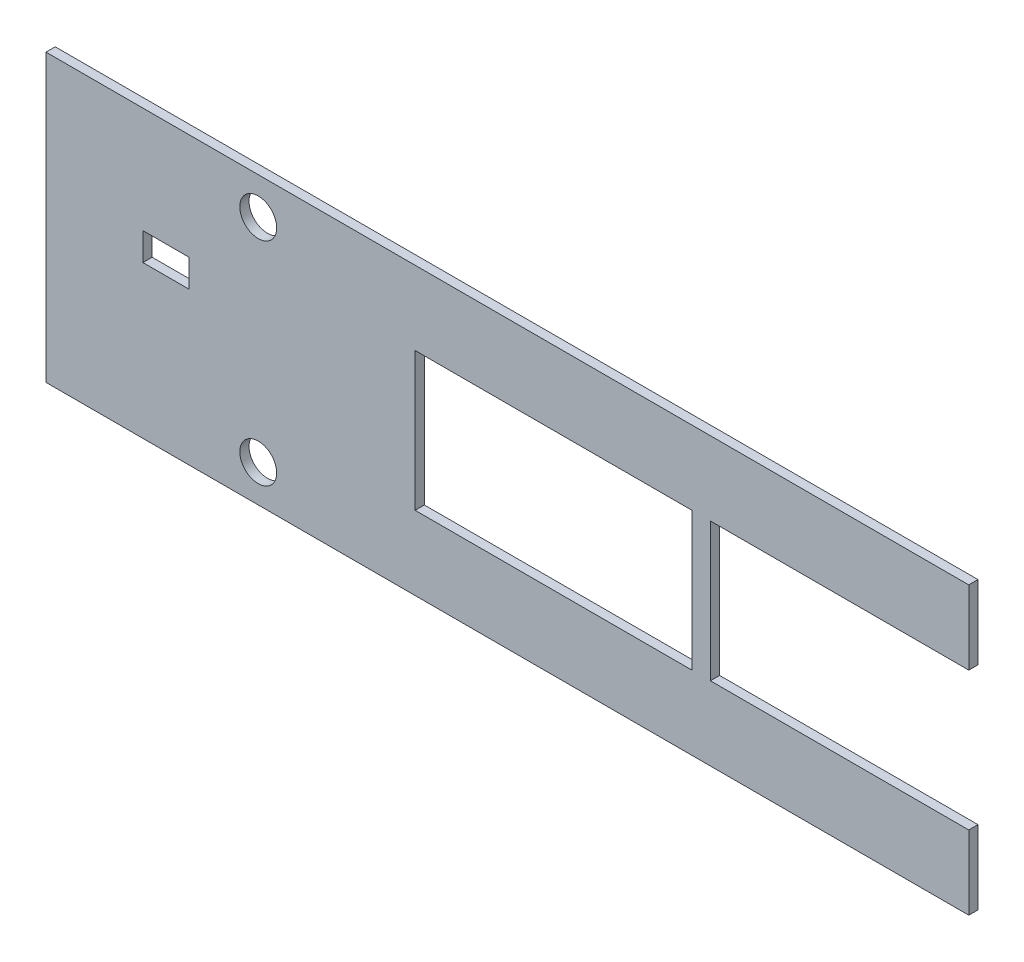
ISO-10303-21;
HEADER;
FILE_DESCRIPTION(('STEP AP214'),'2;1');
FILE_NAME('part.step','',(''),(''),'','','');
FILE_SCHEMA(('AUTOMOTIVE_DESIGN { 1 0 10303 214 1 1 1 1 }'));
ENDSEC;
DATA;
#1=APPLICATION_CONTEXT('core data for automotive mechanical design processes');
#2=APPLICATION_PROTOCOL_DEFINITION('international standard','automotive_design',2000,#1);
#3=PRODUCT_CONTEXT('',#1,'mechanical');
#4=PRODUCT('Part','Part','',(#3));
#5=PRODUCT_RELATED_PRODUCT_CATEGORY('part','',(#4));
#6=PRODUCT_DEFINITION_FORMATION('','',#4);
#7=PRODUCT_DEFINITION_CONTEXT('part definition',#1,'design');
#8=PRODUCT_DEFINITION('design','',#6,#7);
#9=PRODUCT_DEFINITION_SHAPE('','',#8);
#10=(LENGTH_UNIT() NAMED_UNIT(*) SI_UNIT(.MILLI.,.METRE.));
#11=(NAMED_UNIT(*) PLANE_ANGLE_UNIT() SI_UNIT($,.RADIAN.));
#12=(NAMED_UNIT(*) SI_UNIT($,.STERADIAN.) SOLID_ANGLE_UNIT());
#13=UNCERTAINTY_MEASURE_WITH_UNIT(LENGTH_MEASURE(1.E-05),#10,'distance_accuracy_value','');
#14=(GEOMETRIC_REPRESENTATION_CONTEXT(3) GLOBAL_UNCERTAINTY_ASSIGNED_CONTEXT((#13)) GLOBAL_UNIT_ASSIGNED_CONTEXT((#10,
#11,#12)) REPRESENTATION_CONTEXT('',''));
#15=CARTESIAN_POINT('',(0.,0.,0.));
#16=DIRECTION('',(0.,0.,1.));
#17=DIRECTION('',(1.,0.,0.));
#18=AXIS2_PLACEMENT_3D('',#15,#16,#17);
#19=CARTESIAN_POINT('',(0.,0.,1.));
#20=DIRECTION('',(0.,0.,1.));
#21=DIRECTION('',(1.,0.,0.));
#22=AXIS2_PLACEMENT_3D('',#19,#20,#21);
#23=PLANE('',#22);
#24=CARTESIAN_POINT('',(-17.,19.,1.));
#25=DIRECTION('',(0.,0.,1.));
#26=DIRECTION('',(1.,0.,0.));
#27=AXIS2_PLACEMENT_3D('',#24,#25,#26);
#28=CIRCLE('',#27,2.);
#29=CARTESIAN_POINT('',(-15.,19.,1.));
#30=VERTEX_POINT('',#29);
#31=EDGE_CURVE('E179',#30,#30,#28,.T.);
#32=ORIENTED_EDGE('',*,*,#31,.F.);
#33=EDGE_LOOP('',(#32));
#34=FACE_BOUND('',#33,.T.);
#35=DIRECTION('',(1.,0.,0.));
#36=VECTOR('',#35,1.);
#37=CARTESIAN_POINT('',(0.,0.,1.));
#38=LINE('',#37,#36);
#39=CARTESIAN_POINT('',(0.,0.,1.));
#40=VERTEX_POINT('',#39);
#41=CARTESIAN_POINT('',(30.,0.,1.));
#42=VERTEX_POINT('',#41);
#43=EDGE_CURVE('E191',#40,#42,#38,.T.);
#44=ORIENTED_EDGE('',*,*,#43,.F.);
#45=DIRECTION('',(0.,-1.,0.));
#46=VECTOR('',#45,1.);
#47=CARTESIAN_POINT('',(0.,0.,1.));
#48=LINE('',#47,#46);
#49=CARTESIAN_POINT('',(0.,15.,1.));
#50=VERTEX_POINT('',#49);
#51=EDGE_CURVE('E189',#50,#40,#48,.T.);
#52=ORIENTED_EDGE('',*,*,#51,.F.);
#53=DIRECTION('',(-1.,0.,0.));
#54=VECTOR('',#53,1.);
#55=CARTESIAN_POINT('',(0.,15.,1.));
#56=LINE('',#55,#54);
#57=CARTESIAN_POINT('',(30.,15.,1.));
#58=VERTEX_POINT('',#57);
#59=EDGE_CURVE('E197',#58,#50,#56,.T.);
#60=ORIENTED_EDGE('',*,*,#59,.F.);
#61=DIRECTION('',(0.,1.,0.));
#62=VECTOR('',#61,1.);
#63=CARTESIAN_POINT('',(30.,0.,1.));
#64=LINE('',#63,#62);
#65=EDGE_CURVE('E194',#42,#58,#64,.T.);
#66=ORIENTED_EDGE('',*,*,#65,.F.);
#67=EDGE_LOOP('',(#44,#52,#60,#66));
#68=FACE_BOUND('',#67,.T.);
#69=DIRECTION('',(0.,1.,0.));
#70=VECTOR('',#69,1.);
#71=CARTESIAN_POINT('',(60.,23.,1.));
#72=LINE('',#71,#70);
#73=CARTESIAN_POINT('',(60.,15.,1.));
#74=VERTEX_POINT('',#73);
#75=CARTESIAN_POINT('',(60.,23.,1.));
#76=VERTEX_POINT('',#75);
#77=EDGE_CURVE('E220',#74,#76,#72,.T.);
#78=ORIENTED_EDGE('',*,*,#77,.T.);
#79=DIRECTION('',(-1.,0.,0.));
#80=VECTOR('',#79,1.);
#81=CARTESIAN_POINT('',(-40.,23.,1.));
#82=LINE('',#81,#80);
#83=CARTESIAN_POINT('',(-40.,23.,1.));
#84=VERTEX_POINT('',#83);
#85=EDGE_CURVE('E223',#76,#84,#82,.T.);
#86=ORIENTED_EDGE('',*,*,#85,.T.);
#87=DIRECTION('',(0.,-1.,0.));
#88=VECTOR('',#87,1.);
#89=CARTESIAN_POINT('',(-40.,-8.,1.));
#90=LINE('',#89,#88);
#91=CARTESIAN_POINT('',(-40.,-8.,1.));
#92=VERTEX_POINT('',#91);
#93=EDGE_CURVE('E226',#84,#92,#90,.T.);
#94=ORIENTED_EDGE('',*,*,#93,.T.);
#95=DIRECTION('',(1.,0.,0.));
#96=VECTOR('',#95,1.);
#97=CARTESIAN_POINT('',(-40.,-8.,1.));
#98=LINE('',#97,#96);
#99=CARTESIAN_POINT('',(60.,-8.,1.));
#100=VERTEX_POINT('',#99);
#101=EDGE_CURVE('E228',#92,#100,#98,.T.);
#102=ORIENTED_EDGE('',*,*,#101,.T.);
#103=DIRECTION('',(0.,1.,0.));
#104=VECTOR('',#103,1.);
#105=CARTESIAN_POINT('',(60.,0.,1.));
#106=LINE('',#105,#104);
#107=CARTESIAN_POINT('',(60.,0.,1.));
#108=VERTEX_POINT('',#107);
#109=EDGE_CURVE('E230',#100,#108,#106,.T.);
#110=ORIENTED_EDGE('',*,*,#109,.T.);
#111=DIRECTION('',(-1.,0.,0.));
#112=VECTOR('',#111,1.);
#113=CARTESIAN_POINT('',(32.,0.,1.));
#114=LINE('',#113,#112);
#115=CARTESIAN_POINT('',(32.,0.,1.));
#116=VERTEX_POINT('',#115);
#117=EDGE_CURVE('E232',#108,#116,#114,.T.);
#118=ORIENTED_EDGE('',*,*,#117,.T.);
#119=DIRECTION('',(0.,1.,0.));
#120=VECTOR('',#119,1.);
#121=CARTESIAN_POINT('',(32.,0.,1.));
#122=LINE('',#121,#120);
#123=CARTESIAN_POINT('',(32.,15.,1.));
#124=VERTEX_POINT('',#123);
#125=EDGE_CURVE('E234',#116,#124,#122,.T.);
#126=ORIENTED_EDGE('',*,*,#125,.T.);
#127=DIRECTION('',(1.,0.,0.));
#128=VECTOR('',#127,1.);
#129=CARTESIAN_POINT('',(32.,15.,1.));
#130=LINE('',#129,#128);
#131=EDGE_CURVE('E236',#124,#74,#130,.T.);
#132=ORIENTED_EDGE('',*,*,#131,.T.);
#133=EDGE_LOOP('',(#78,#86,#94,#102,#110,#118,#126,#132));
#134=FACE_BOUND('',#133,.T.);
#135=DIRECTION('',(1.,0.,0.));
#136=VECTOR('',#135,1.);
#137=CARTESIAN_POINT('',(-29.5,8.5,1.));
#138=LINE('',#137,#136);
#139=CARTESIAN_POINT('',(-29.5,8.5,1.));
#140=VERTEX_POINT('',#139);
#141=CARTESIAN_POINT('',(-24.5,8.5,1.));
#142=VERTEX_POINT('',#141);
#143=EDGE_CURVE('E158',#140,#142,#138,.T.);
#144=ORIENTED_EDGE('',*,*,#143,.F.);
#145=DIRECTION('',(0.,-1.,0.));
#146=VECTOR('',#145,1.);
#147=CARTESIAN_POINT('',(-29.5,11.5,1.));
#148=LINE('',#147,#146);
#149=CARTESIAN_POINT('',(-29.5,11.5,1.));
#150=VERTEX_POINT('',#149);
#151=EDGE_CURVE('E150',#150,#140,#148,.T.);
#152=ORIENTED_EDGE('',*,*,#151,.F.);
#153=DIRECTION('',(-1.,0.,0.));
#154=VECTOR('',#153,1.);
#155=CARTESIAN_POINT('',(-29.5,11.5,1.));
#156=LINE('',#155,#154);
#157=CARTESIAN_POINT('',(-24.5,11.5,1.));
#158=VERTEX_POINT('',#157);
#159=EDGE_CURVE('E173',#158,#150,#156,.T.);
#160=ORIENTED_EDGE('',*,*,#159,.F.);
#161=DIRECTION('',(0.,1.,0.));
#162=VECTOR('',#161,1.);
#163=CARTESIAN_POINT('',(-24.5,11.5,1.));
#164=LINE('',#163,#162);
#165=EDGE_CURVE('E171',#142,#158,#164,.T.);
#166=ORIENTED_EDGE('',*,*,#165,.F.);
#167=EDGE_LOOP('',(#144,#152,#160,#166));
#168=FACE_BOUND('',#167,.T.);
#169=CARTESIAN_POINT('',(-17.,-4.,1.));
#170=DIRECTION('',(0.,0.,1.));
#171=DIRECTION('',(1.,0.,0.));
#172=AXIS2_PLACEMENT_3D('',#169,#170,#171);
#173=CIRCLE('',#172,2.);
#174=CARTESIAN_POINT('',(-15.,-4.,1.));
#175=VERTEX_POINT('',#174);
#176=EDGE_CURVE('E388',#175,#175,#173,.T.);
#177=ORIENTED_EDGE('',*,*,#176,.F.);
#178=EDGE_LOOP('',(#177));
#179=FACE_BOUND('',#178,.T.);
#180=ADVANCED_FACE('F37',(#34,#68,#134,#168,#179),#23,.T.);
#181=CARTESIAN_POINT('',(0.,0.,0.));
#182=DIRECTION('',(0.,0.,1.));
#183=DIRECTION('',(1.,0.,0.));
#184=AXIS2_PLACEMENT_3D('',#181,#182,#183);
#185=PLANE('',#184);
#186=CARTESIAN_POINT('',(-17.,19.,0.));
#187=DIRECTION('',(0.,0.,1.));
#188=DIRECTION('',(1.,0.,0.));
#189=AXIS2_PLACEMENT_3D('',#186,#187,#188);
#190=CIRCLE('',#189,2.);
#191=CARTESIAN_POINT('',(-15.,19.,0.));
#192=VERTEX_POINT('',#191);
#193=EDGE_CURVE('E394',#192,#192,#190,.T.);
#194=ORIENTED_EDGE('',*,*,#193,.T.);
#195=EDGE_LOOP('',(#194));
#196=FACE_BOUND('',#195,.T.);
#197=DIRECTION('',(0.,-1.,0.));
#198=VECTOR('',#197,1.);
#199=CARTESIAN_POINT('',(0.,0.,0.));
#200=LINE('',#199,#198);
#201=CARTESIAN_POINT('',(0.,15.,0.));
#202=VERTEX_POINT('',#201);
#203=CARTESIAN_POINT('',(0.,0.,0.));
#204=VERTEX_POINT('',#203);
#205=EDGE_CURVE('E166',#202,#204,#200,.T.);
#206=ORIENTED_EDGE('',*,*,#205,.T.);
#207=DIRECTION('',(1.,0.,0.));
#208=VECTOR('',#207,1.);
#209=CARTESIAN_POINT('',(0.,0.,0.));
#210=LINE('',#209,#208);
#211=CARTESIAN_POINT('',(30.,0.,0.));
#212=VERTEX_POINT('',#211);
#213=EDGE_CURVE('E202',#204,#212,#210,.T.);
#214=ORIENTED_EDGE('',*,*,#213,.T.);
#215=DIRECTION('',(0.,1.,0.));
#216=VECTOR('',#215,1.);
#217=CARTESIAN_POINT('',(30.,0.,0.));
#218=LINE('',#217,#216);
#219=CARTESIAN_POINT('',(30.,15.,0.));
#220=VERTEX_POINT('',#219);
#221=EDGE_CURVE('E205',#212,#220,#218,.T.);
#222=ORIENTED_EDGE('',*,*,#221,.T.);
#223=DIRECTION('',(-1.,0.,0.));
#224=VECTOR('',#223,1.);
#225=CARTESIAN_POINT('',(0.,15.,0.));
#226=LINE('',#225,#224);
#227=EDGE_CURVE('E192',#220,#202,#226,.T.);
#228=ORIENTED_EDGE('',*,*,#227,.T.);
#229=EDGE_LOOP('',(#206,#214,#222,#228));
#230=FACE_BOUND('',#229,.T.);
#231=DIRECTION('',(0.,1.,0.));
#232=VECTOR('',#231,1.);
#233=CARTESIAN_POINT('',(60.,23.,0.));
#234=LINE('',#233,#232);
#235=CARTESIAN_POINT('',(60.,15.,0.));
#236=VERTEX_POINT('',#235);
#237=CARTESIAN_POINT('',(60.,23.,0.));
#238=VERTEX_POINT('',#237);
#239=EDGE_CURVE('E219',#236,#238,#234,.T.);
#240=ORIENTED_EDGE('',*,*,#239,.F.);
#241=DIRECTION('',(1.,0.,0.));
#242=VECTOR('',#241,1.);
#243=CARTESIAN_POINT('',(32.,15.,0.));
#244=LINE('',#243,#242);
#245=CARTESIAN_POINT('',(32.,15.,0.));
#246=VERTEX_POINT('',#245);
#247=EDGE_CURVE('E224',#246,#236,#244,.T.);
#248=ORIENTED_EDGE('',*,*,#247,.F.);
#249=DIRECTION('',(0.,1.,0.));
#250=VECTOR('',#249,1.);
#251=CARTESIAN_POINT('',(32.,0.,0.));
#252=LINE('',#251,#250);
#253=CARTESIAN_POINT('',(32.,0.,0.));
#254=VERTEX_POINT('',#253);
#255=EDGE_CURVE('E251',#254,#246,#252,.T.);
#256=ORIENTED_EDGE('',*,*,#255,.F.);
#257=DIRECTION('',(-1.,0.,0.));
#258=VECTOR('',#257,1.);
#259=CARTESIAN_POINT('',(32.,0.,0.));
#260=LINE('',#259,#258);
#261=CARTESIAN_POINT('',(60.,0.,0.));
#262=VERTEX_POINT('',#261);
#263=EDGE_CURVE('E249',#262,#254,#260,.T.);
#264=ORIENTED_EDGE('',*,*,#263,.F.);
#265=DIRECTION('',(0.,1.,0.));
#266=VECTOR('',#265,1.);
#267=CARTESIAN_POINT('',(60.,0.,0.));
#268=LINE('',#267,#266);
#269=CARTESIAN_POINT('',(60.,-8.,0.));
#270=VERTEX_POINT('',#269);
#271=EDGE_CURVE('E247',#270,#262,#268,.T.);
#272=ORIENTED_EDGE('',*,*,#271,.F.);
#273=DIRECTION('',(1.,0.,0.));
#274=VECTOR('',#273,1.);
#275=CARTESIAN_POINT('',(-40.,-8.,0.));
#276=LINE('',#275,#274);
#277=CARTESIAN_POINT('',(-40.,-8.,0.));
#278=VERTEX_POINT('',#277);
#279=EDGE_CURVE('E245',#278,#270,#276,.T.);
#280=ORIENTED_EDGE('',*,*,#279,.F.);
#281=DIRECTION('',(0.,-1.,0.));
#282=VECTOR('',#281,1.);
#283=CARTESIAN_POINT('',(-40.,-8.,0.));
#284=LINE('',#283,#282);
#285=CARTESIAN_POINT('',(-40.,23.,0.));
#286=VERTEX_POINT('',#285);
#287=EDGE_CURVE('E243',#286,#278,#284,.T.);
#288=ORIENTED_EDGE('',*,*,#287,.F.);
#289=DIRECTION('',(-1.,0.,0.));
#290=VECTOR('',#289,1.);
#291=CARTESIAN_POINT('',(-40.,23.,0.));
#292=LINE('',#291,#290);
#293=EDGE_CURVE('E241',#238,#286,#292,.T.);
#294=ORIENTED_EDGE('',*,*,#293,.F.);
#295=EDGE_LOOP('',(#240,#248,#256,#264,#272,#280,#288,#294));
#296=FACE_BOUND('',#295,.T.);
#297=DIRECTION('',(0.,-1.,0.));
#298=VECTOR('',#297,1.);
#299=CARTESIAN_POINT('',(-29.5,11.5,0.));
#300=LINE('',#299,#298);
#301=CARTESIAN_POINT('',(-29.5,11.5,0.));
#302=VERTEX_POINT('',#301);
#303=CARTESIAN_POINT('',(-29.5,8.5,0.));
#304=VERTEX_POINT('',#303);
#305=EDGE_CURVE('E60',#302,#304,#300,.T.);
#306=ORIENTED_EDGE('',*,*,#305,.T.);
#307=DIRECTION('',(1.,0.,0.));
#308=VECTOR('',#307,1.);
#309=CARTESIAN_POINT('',(-29.5,8.5,0.));
#310=LINE('',#309,#308);
#311=CARTESIAN_POINT('',(-24.5,8.5,0.));
#312=VERTEX_POINT('',#311);
#313=EDGE_CURVE('E165',#304,#312,#310,.T.);
#314=ORIENTED_EDGE('',*,*,#313,.T.);
#315=DIRECTION('',(0.,1.,0.));
#316=VECTOR('',#315,1.);
#317=CARTESIAN_POINT('',(-24.5,11.5,0.));
#318=LINE('',#317,#316);
#319=CARTESIAN_POINT('',(-24.5,11.5,0.));
#320=VERTEX_POINT('',#319);
#321=EDGE_CURVE('E181',#312,#320,#318,.T.);
#322=ORIENTED_EDGE('',*,*,#321,.T.);
#323=DIRECTION('',(-1.,0.,0.));
#324=VECTOR('',#323,1.);
#325=CARTESIAN_POINT('',(-29.5,11.5,0.));
#326=LINE('',#325,#324);
#327=EDGE_CURVE('E159',#320,#302,#326,.T.);
#328=ORIENTED_EDGE('',*,*,#327,.T.);
#329=EDGE_LOOP('',(#306,#314,#322,#328));
#330=FACE_BOUND('',#329,.T.);
#331=CARTESIAN_POINT('',(-17.,-4.,0.));
#332=DIRECTION('',(0.,0.,1.));
#333=DIRECTION('',(1.,0.,0.));
#334=AXIS2_PLACEMENT_3D('',#331,#332,#333);
#335=CIRCLE('',#334,2.);
#336=CARTESIAN_POINT('',(-15.,-4.,0.));
#337=VERTEX_POINT('',#336);
#338=EDGE_CURVE('E391',#337,#337,#335,.T.);
#339=ORIENTED_EDGE('',*,*,#338,.T.);
#340=EDGE_LOOP('',(#339));
#341=FACE_BOUND('',#340,.T.);
#342=ADVANCED_FACE('F281',(#196,#230,#296,#330,#341),#185,.F.);
#343=CARTESIAN_POINT('',(60.,23.,1.));
#344=DIRECTION('',(-1.,0.,0.));
#345=DIRECTION('',(0.,0.,1.));
#346=AXIS2_PLACEMENT_3D('',#343,#344,#345);
#347=PLANE('',#346);
#348=ORIENTED_EDGE('',*,*,#239,.T.);
#349=DIRECTION('',(0.,0.,-1.));
#350=VECTOR('',#349,1.);
#351=CARTESIAN_POINT('',(60.,23.,1.));
#352=LINE('',#351,#350);
#353=EDGE_CURVE('E11',#76,#238,#352,.T.);
#354=ORIENTED_EDGE('',*,*,#353,.F.);
#355=ORIENTED_EDGE('',*,*,#77,.F.);
#356=DIRECTION('',(0.,0.,-1.));
#357=VECTOR('',#356,1.);
#358=CARTESIAN_POINT('',(60.,15.,1.));
#359=LINE('',#358,#357);
#360=EDGE_CURVE('E238',#74,#236,#359,.T.);
#361=ORIENTED_EDGE('',*,*,#360,.T.);
#362=EDGE_LOOP('',(#348,#354,#355,#361));
#363=FACE_BOUND('',#362,.T.);
#364=ADVANCED_FACE('F39',(#363),#347,.F.);
#365=CARTESIAN_POINT('',(-40.,23.,1.));
#366=DIRECTION('',(0.,-1.,0.));
#367=DIRECTION('',(1.,0.,0.));
#368=AXIS2_PLACEMENT_3D('',#365,#366,#367);
#369=PLANE('',#368);
#370=ORIENTED_EDGE('',*,*,#293,.T.);
#371=DIRECTION('',(0.,0.,-1.));
#372=VECTOR('',#371,1.);
#373=CARTESIAN_POINT('',(-40.,23.,1.));
#374=LINE('',#373,#372);
#375=EDGE_CURVE('E45',#84,#286,#374,.T.);
#376=ORIENTED_EDGE('',*,*,#375,.F.);
#377=ORIENTED_EDGE('',*,*,#85,.F.);
#378=ORIENTED_EDGE('',*,*,#353,.T.);
#379=EDGE_LOOP('',(#370,#376,#377,#378));
#380=FACE_BOUND('',#379,.T.);
#381=ADVANCED_FACE('F298',(#380),#369,.F.);
#382=CARTESIAN_POINT('',(-40.,-8.,1.));
#383=DIRECTION('',(1.,0.,0.));
#384=DIRECTION('',(0.,1.,0.));
#385=AXIS2_PLACEMENT_3D('',#382,#383,#384);
#386=PLANE('',#385);
#387=ORIENTED_EDGE('',*,*,#287,.T.);
#388=DIRECTION('',(0.,0.,-1.));
#389=VECTOR('',#388,1.);
#390=CARTESIAN_POINT('',(-40.,-8.,1.));
#391=LINE('',#390,#389);
#392=EDGE_CURVE('E268',#92,#278,#391,.T.);
#393=ORIENTED_EDGE('',*,*,#392,.F.);
#394=ORIENTED_EDGE('',*,*,#93,.F.);
#395=ORIENTED_EDGE('',*,*,#375,.T.);
#396=EDGE_LOOP('',(#387,#393,#394,#395));
#397=FACE_BOUND('',#396,.T.);
#398=ADVANCED_FACE('F275',(#397),#386,.F.);
#399=CARTESIAN_POINT('',(-40.,-8.,1.));
#400=DIRECTION('',(0.,1.,0.));
#401=DIRECTION('',(-1.,0.,0.));
#402=AXIS2_PLACEMENT_3D('',#399,#400,#401);
#403=PLANE('',#402);
#404=ORIENTED_EDGE('',*,*,#279,.T.);
#405=DIRECTION('',(0.,0.,-1.));
#406=VECTOR('',#405,1.);
#407=CARTESIAN_POINT('',(60.,-8.,1.));
#408=LINE('',#407,#406);
#409=EDGE_CURVE('E265',#100,#270,#408,.T.);
#410=ORIENTED_EDGE('',*,*,#409,.F.);
#411=ORIENTED_EDGE('',*,*,#101,.F.);
#412=ORIENTED_EDGE('',*,*,#392,.T.);
#413=EDGE_LOOP('',(#404,#410,#411,#412));
#414=FACE_BOUND('',#413,.T.);
#415=ADVANCED_FACE('F287',(#414),#403,.F.);
#416=CARTESIAN_POINT('',(60.,0.,1.));
#417=DIRECTION('',(-1.,0.,0.));
#418=DIRECTION('',(0.,-1.,0.));
#419=AXIS2_PLACEMENT_3D('',#416,#417,#418);
#420=PLANE('',#419);
#421=ORIENTED_EDGE('',*,*,#271,.T.);
#422=DIRECTION('',(0.,0.,-1.));
#423=VECTOR('',#422,1.);
#424=CARTESIAN_POINT('',(60.,0.,1.));
#425=LINE('',#424,#423);
#426=EDGE_CURVE('E262',#108,#262,#425,.T.);
#427=ORIENTED_EDGE('',*,*,#426,.F.);
#428=ORIENTED_EDGE('',*,*,#109,.F.);
#429=ORIENTED_EDGE('',*,*,#409,.T.);
#430=EDGE_LOOP('',(#421,#427,#428,#429));
#431=FACE_BOUND('',#430,.T.);
#432=ADVANCED_FACE('F291',(#431),#420,.F.);
#433=CARTESIAN_POINT('',(32.,0.,1.));
#434=DIRECTION('',(0.,-1.,0.));
#435=DIRECTION('',(0.,0.,-1.));
#436=AXIS2_PLACEMENT_3D('',#433,#434,#435);
#437=PLANE('',#436);
#438=ORIENTED_EDGE('',*,*,#263,.T.);
#439=DIRECTION('',(0.,0.,-1.));
#440=VECTOR('',#439,1.);
#441=CARTESIAN_POINT('',(32.,0.,1.));
#442=LINE('',#441,#440);
#443=EDGE_CURVE('E259',#116,#254,#442,.T.);
#444=ORIENTED_EDGE('',*,*,#443,.F.);
#445=ORIENTED_EDGE('',*,*,#117,.F.);
#446=ORIENTED_EDGE('',*,*,#426,.T.);
#447=EDGE_LOOP('',(#438,#444,#445,#446));
#448=FACE_BOUND('',#447,.T.);
#449=ADVANCED_FACE('F311',(#448),#437,.F.);
#450=CARTESIAN_POINT('',(32.,0.,1.));
#451=DIRECTION('',(-1.,0.,0.));
#452=DIRECTION('',(0.,0.,1.));
#453=AXIS2_PLACEMENT_3D('',#450,#451,#452);
#454=PLANE('',#453);
#455=ORIENTED_EDGE('',*,*,#255,.T.);
#456=DIRECTION('',(0.,0.,-1.));
#457=VECTOR('',#456,1.);
#458=CARTESIAN_POINT('',(32.,15.,1.));
#459=LINE('',#458,#457);
#460=EDGE_CURVE('E256',#124,#246,#459,.T.);
#461=ORIENTED_EDGE('',*,*,#460,.F.);
#462=ORIENTED_EDGE('',*,*,#125,.F.);
#463=ORIENTED_EDGE('',*,*,#443,.T.);
#464=EDGE_LOOP('',(#455,#461,#462,#463));
#465=FACE_BOUND('',#464,.T.);
#466=ADVANCED_FACE('F309',(#465),#454,.F.);
#467=CARTESIAN_POINT('',(32.,15.,1.));
#468=DIRECTION('',(0.,1.,0.));
#469=DIRECTION('',(0.,0.,1.));
#470=AXIS2_PLACEMENT_3D('',#467,#468,#469);
#471=PLANE('',#470);
#472=ORIENTED_EDGE('',*,*,#247,.T.);
#473=ORIENTED_EDGE('',*,*,#360,.F.);
#474=ORIENTED_EDGE('',*,*,#131,.F.);
#475=ORIENTED_EDGE('',*,*,#460,.T.);
#476=EDGE_LOOP('',(#472,#473,#474,#475));
#477=FACE_BOUND('',#476,.T.);
#478=ADVANCED_FACE('F304',(#477),#471,.F.);
#479=CARTESIAN_POINT('',(0.,0.,1.));
#480=DIRECTION('',(1.,0.,0.));
#481=DIRECTION('',(0.,0.,-1.));
#482=AXIS2_PLACEMENT_3D('',#479,#480,#481);
#483=PLANE('',#482);
#484=ORIENTED_EDGE('',*,*,#205,.F.);
#485=DIRECTION('',(0.,0.,-1.));
#486=VECTOR('',#485,1.);
#487=CARTESIAN_POINT('',(0.,15.,1.));
#488=LINE('',#487,#486);
#489=EDGE_CURVE('E199',#50,#202,#488,.T.);
#490=ORIENTED_EDGE('',*,*,#489,.F.);
#491=ORIENTED_EDGE('',*,*,#51,.T.);
#492=DIRECTION('',(0.,0.,-1.));
#493=VECTOR('',#492,1.);
#494=CARTESIAN_POINT('',(0.,0.,1.));
#495=LINE('',#494,#493);
#496=EDGE_CURVE('E216',#40,#204,#495,.T.);
#497=ORIENTED_EDGE('',*,*,#496,.T.);
#498=EDGE_LOOP('',(#484,#490,#491,#497));
#499=FACE_BOUND('',#498,.T.);
#500=ADVANCED_FACE('F331',(#499),#483,.T.);
#501=CARTESIAN_POINT('',(0.,0.,1.));
#502=DIRECTION('',(0.,1.,0.));
#503=DIRECTION('',(0.,0.,1.));
#504=AXIS2_PLACEMENT_3D('',#501,#502,#503);
#505=PLANE('',#504);
#506=ORIENTED_EDGE('',*,*,#213,.F.);
#507=ORIENTED_EDGE('',*,*,#496,.F.);
#508=ORIENTED_EDGE('',*,*,#43,.T.);
#509=DIRECTION('',(0.,0.,-1.));
#510=VECTOR('',#509,1.);
#511=CARTESIAN_POINT('',(30.,0.,1.));
#512=LINE('',#511,#510);
#513=EDGE_CURVE('E214',#42,#212,#512,.T.);
#514=ORIENTED_EDGE('',*,*,#513,.T.);
#515=EDGE_LOOP('',(#506,#507,#508,#514));
#516=FACE_BOUND('',#515,.T.);
#517=ADVANCED_FACE('F338',(#516),#505,.T.);
#518=CARTESIAN_POINT('',(30.,0.,1.));
#519=DIRECTION('',(-1.,0.,0.));
#520=DIRECTION('',(0.,0.,1.));
#521=AXIS2_PLACEMENT_3D('',#518,#519,#520);
#522=PLANE('',#521);
#523=ORIENTED_EDGE('',*,*,#221,.F.);
#524=ORIENTED_EDGE('',*,*,#513,.F.);
#525=ORIENTED_EDGE('',*,*,#65,.T.);
#526=DIRECTION('',(0.,0.,-1.));
#527=VECTOR('',#526,1.);
#528=CARTESIAN_POINT('',(30.,15.,1.));
#529=LINE('',#528,#527);
#530=EDGE_CURVE('E212',#58,#220,#529,.T.);
#531=ORIENTED_EDGE('',*,*,#530,.T.);
#532=EDGE_LOOP('',(#523,#524,#525,#531));
#533=FACE_BOUND('',#532,.T.);
#534=ADVANCED_FACE('F343',(#533),#522,.T.);
#535=CARTESIAN_POINT('',(0.,15.,1.));
#536=DIRECTION('',(0.,-1.,0.));
#537=DIRECTION('',(0.,0.,-1.));
#538=AXIS2_PLACEMENT_3D('',#535,#536,#537);
#539=PLANE('',#538);
#540=ORIENTED_EDGE('',*,*,#227,.F.);
#541=ORIENTED_EDGE('',*,*,#530,.F.);
#542=ORIENTED_EDGE('',*,*,#59,.T.);
#543=ORIENTED_EDGE('',*,*,#489,.T.);
#544=EDGE_LOOP('',(#540,#541,#542,#543));
#545=FACE_BOUND('',#544,.T.);
#546=ADVANCED_FACE('F351',(#545),#539,.T.);
#547=CARTESIAN_POINT('',(-29.5,11.5,1.));
#548=DIRECTION('',(1.,0.,0.));
#549=DIRECTION('',(0.,0.,-1.));
#550=AXIS2_PLACEMENT_3D('',#547,#548,#549);
#551=PLANE('',#550);
#552=ORIENTED_EDGE('',*,*,#305,.F.);
#553=DIRECTION('',(0.,0.,-1.));
#554=VECTOR('',#553,1.);
#555=CARTESIAN_POINT('',(-29.5,11.5,1.));
#556=LINE('',#555,#554);
#557=EDGE_CURVE('E154',#150,#302,#556,.T.);
#558=ORIENTED_EDGE('',*,*,#557,.F.);
#559=ORIENTED_EDGE('',*,*,#151,.T.);
#560=DIRECTION('',(0.,0.,-1.));
#561=VECTOR('',#560,1.);
#562=CARTESIAN_POINT('',(-29.5,8.5,1.));
#563=LINE('',#562,#561);
#564=EDGE_CURVE('E153',#140,#304,#563,.T.);
#565=ORIENTED_EDGE('',*,*,#564,.T.);
#566=EDGE_LOOP('',(#552,#558,#559,#565));
#567=FACE_BOUND('',#566,.T.);
#568=ADVANCED_FACE('F152',(#567),#551,.T.);
#569=CARTESIAN_POINT('',(-29.5,8.5,1.));
#570=DIRECTION('',(0.,1.,0.));
#571=DIRECTION('',(0.,0.,1.));
#572=AXIS2_PLACEMENT_3D('',#569,#570,#571);
#573=PLANE('',#572);
#574=ORIENTED_EDGE('',*,*,#313,.F.);
#575=ORIENTED_EDGE('',*,*,#564,.F.);
#576=ORIENTED_EDGE('',*,*,#143,.T.);
#577=DIRECTION('',(0.,0.,-1.));
#578=VECTOR('',#577,1.);
#579=CARTESIAN_POINT('',(-24.5,8.5,1.));
#580=LINE('',#579,#578);
#581=EDGE_CURVE('E167',#142,#312,#580,.T.);
#582=ORIENTED_EDGE('',*,*,#581,.T.);
#583=EDGE_LOOP('',(#574,#575,#576,#582));
#584=FACE_BOUND('',#583,.T.);
#585=ADVANCED_FACE('F162',(#584),#573,.T.);
#586=CARTESIAN_POINT('',(-24.5,11.5,1.));
#587=DIRECTION('',(-1.,0.,0.));
#588=DIRECTION('',(0.,0.,1.));
#589=AXIS2_PLACEMENT_3D('',#586,#587,#588);
#590=PLANE('',#589);
#591=ORIENTED_EDGE('',*,*,#321,.F.);
#592=ORIENTED_EDGE('',*,*,#581,.F.);
#593=ORIENTED_EDGE('',*,*,#165,.T.);
#594=DIRECTION('',(0.,0.,-1.));
#595=VECTOR('',#594,1.);
#596=CARTESIAN_POINT('',(-24.5,11.5,1.));
#597=LINE('',#596,#595);
#598=EDGE_CURVE('E52',#158,#320,#597,.T.);
#599=ORIENTED_EDGE('',*,*,#598,.T.);
#600=EDGE_LOOP('',(#591,#592,#593,#599));
#601=FACE_BOUND('',#600,.T.);
#602=ADVANCED_FACE('F369',(#601),#590,.T.);
#603=CARTESIAN_POINT('',(-29.5,11.5,1.));
#604=DIRECTION('',(0.,-1.,0.));
#605=DIRECTION('',(0.,0.,-1.));
#606=AXIS2_PLACEMENT_3D('',#603,#604,#605);
#607=PLANE('',#606);
#608=ORIENTED_EDGE('',*,*,#327,.F.);
#609=ORIENTED_EDGE('',*,*,#598,.F.);
#610=ORIENTED_EDGE('',*,*,#159,.T.);
#611=ORIENTED_EDGE('',*,*,#557,.T.);
#612=EDGE_LOOP('',(#608,#609,#610,#611));
#613=FACE_BOUND('',#612,.T.);
#614=ADVANCED_FACE('F372',(#613),#607,.T.);
#615=CARTESIAN_POINT('',(-17.,19.,1.));
#616=DIRECTION('',(0.,0.,-1.));
#617=DIRECTION('',(-1.,0.,0.));
#618=AXIS2_PLACEMENT_3D('',#615,#616,#617);
#619=CYLINDRICAL_SURFACE('',#618,2.);
#620=ORIENTED_EDGE('',*,*,#31,.T.);
#621=EDGE_LOOP('',(#620));
#622=FACE_BOUND('',#621,.T.);
#623=ORIENTED_EDGE('',*,*,#193,.F.);
#624=EDGE_LOOP('',(#623));
#625=FACE_BOUND('',#624,.T.);
#626=ADVANCED_FACE('F376',(#622,#625),#619,.F.);
#627=CARTESIAN_POINT('',(-17.,-4.,1.));
#628=DIRECTION('',(0.,0.,-1.));
#629=DIRECTION('',(-1.,0.,0.));
#630=AXIS2_PLACEMENT_3D('',#627,#628,#629);
#631=CYLINDRICAL_SURFACE('',#630,2.);
#632=ORIENTED_EDGE('',*,*,#176,.T.);
#633=EDGE_LOOP('',(#632));
#634=FACE_BOUND('',#633,.T.);
#635=ORIENTED_EDGE('',*,*,#338,.F.);
#636=EDGE_LOOP('',(#635));
#637=FACE_BOUND('',#636,.T.);
#638=ADVANCED_FACE('F379',(#634,#637),#631,.F.);
#639=CLOSED_SHELL('',(#180,#342,#364,#381,#398,#415,#432,#449,#466,#478,#500,#517,#534,#546,
#568,#585,#602,#614,#626,#638));
#640=MANIFOLD_SOLID_BREP('B2',#639);
#641=ADVANCED_BREP_SHAPE_REPRESENTATION('',(#18,#640),#14);
#642=SHAPE_DEFINITION_REPRESENTATION(#9,#641);
ENDSEC;
END-ISO-10303-21;
